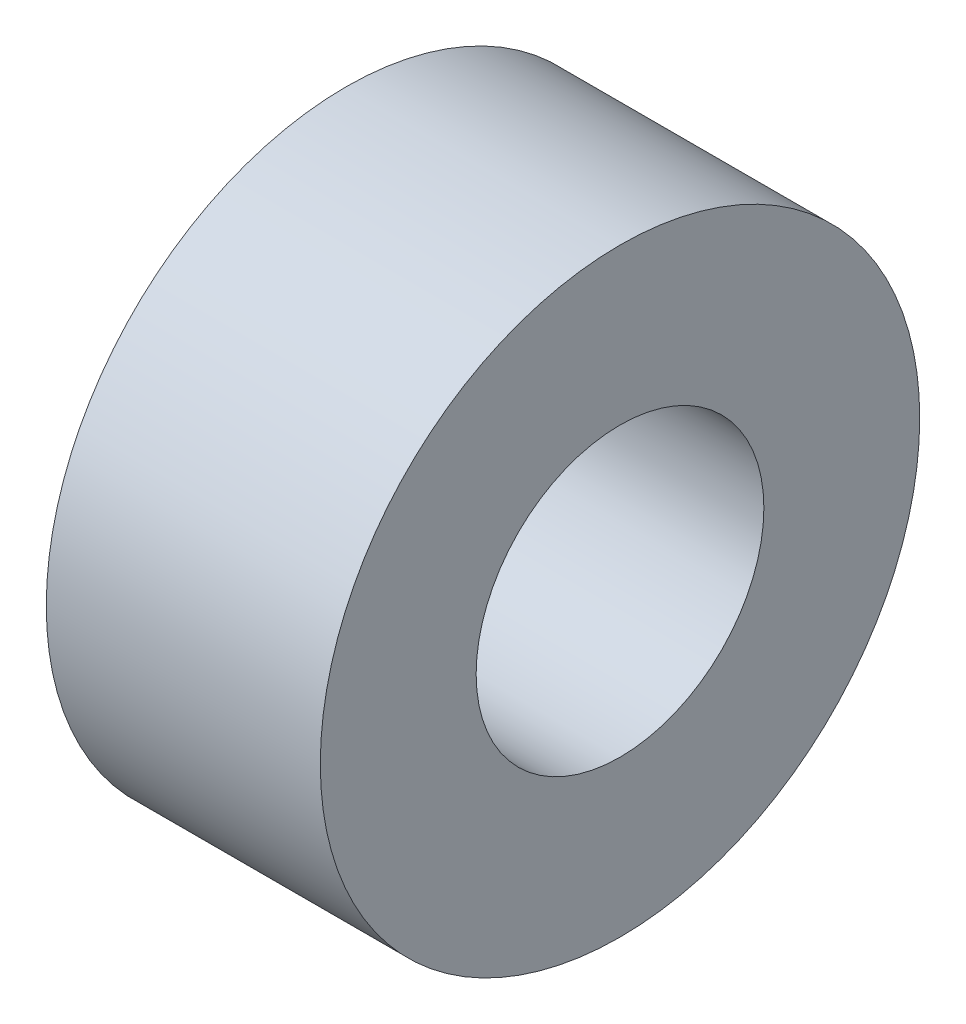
ISO-10303-21;
HEADER;
FILE_DESCRIPTION(('STEP AP214'),'2;1');
FILE_NAME('part.step','',(''),(''),'','','');
FILE_SCHEMA(('AUTOMOTIVE_DESIGN { 1 0 10303 214 1 1 1 1 }'));
ENDSEC;
DATA;
#1=APPLICATION_CONTEXT('core data for automotive mechanical design processes');
#2=APPLICATION_PROTOCOL_DEFINITION('international standard','automotive_design',2000,#1);
#3=PRODUCT_CONTEXT('',#1,'mechanical');
#4=PRODUCT('Part','Part','',(#3));
#5=PRODUCT_RELATED_PRODUCT_CATEGORY('part','',(#4));
#6=PRODUCT_DEFINITION_FORMATION('','',#4);
#7=PRODUCT_DEFINITION_CONTEXT('part definition',#1,'design');
#8=PRODUCT_DEFINITION('design','',#6,#7);
#9=PRODUCT_DEFINITION_SHAPE('','',#8);
#10=(LENGTH_UNIT() NAMED_UNIT(*) SI_UNIT(.MILLI.,.METRE.));
#11=(NAMED_UNIT(*) PLANE_ANGLE_UNIT() SI_UNIT($,.RADIAN.));
#12=(NAMED_UNIT(*) SI_UNIT($,.STERADIAN.) SOLID_ANGLE_UNIT());
#13=UNCERTAINTY_MEASURE_WITH_UNIT(LENGTH_MEASURE(1.E-05),#10,'distance_accuracy_value','');
#14=(GEOMETRIC_REPRESENTATION_CONTEXT(3) GLOBAL_UNCERTAINTY_ASSIGNED_CONTEXT((#13)) GLOBAL_UNIT_ASSIGNED_CONTEXT((#10,
#11,#12)) REPRESENTATION_CONTEXT('',''));
#15=CARTESIAN_POINT('',(0.,0.,0.));
#16=DIRECTION('',(0.,0.,1.));
#17=DIRECTION('',(1.,0.,0.));
#18=AXIS2_PLACEMENT_3D('',#15,#16,#17);
#19=CARTESIAN_POINT('',(0.,0.,-8.75));
#20=DIRECTION('',(1.,0.,0.));
#21=DIRECTION('',(0.,0.,-1.));
#22=AXIS2_PLACEMENT_3D('',#19,#20,#21);
#23=PLANE('',#22);
#24=CARTESIAN_POINT('',(0.,0.,0.));
#25=DIRECTION('',(-1.,0.,0.));
#26=DIRECTION('',(0.,0.,1.));
#27=AXIS2_PLACEMENT_3D('',#24,#25,#26);
#28=CIRCLE('',#27,4.2);
#29=CARTESIAN_POINT('',(0.,0.,4.2));
#30=VERTEX_POINT('',#29);
#31=EDGE_CURVE('E10',#30,#30,#28,.T.);
#32=ORIENTED_EDGE('',*,*,#31,.F.);
#33=EDGE_LOOP('',(#32));
#34=FACE_BOUND('',#33,.T.);
#35=CARTESIAN_POINT('',(0.,0.,0.));
#36=DIRECTION('',(-1.,0.,0.));
#37=DIRECTION('',(0.,0.,1.));
#38=AXIS2_PLACEMENT_3D('',#35,#36,#37);
#39=CIRCLE('',#38,8.75);
#40=CARTESIAN_POINT('',(0.,0.,8.75));
#41=VERTEX_POINT('',#40);
#42=EDGE_CURVE('E45',#41,#41,#39,.T.);
#43=ORIENTED_EDGE('',*,*,#42,.T.);
#44=EDGE_LOOP('',(#43));
#45=FACE_BOUND('',#44,.T.);
#46=ADVANCED_FACE('F31',(#34,#45),#23,.F.);
#47=CARTESIAN_POINT('',(0.,0.,0.));
#48=DIRECTION('',(-1.,0.,0.));
#49=DIRECTION('',(0.,0.,1.));
#50=AXIS2_PLACEMENT_3D('',#47,#48,#49);
#51=CYLINDRICAL_SURFACE('',#50,4.2);
#52=CARTESIAN_POINT('',(8.,0.,0.));
#53=DIRECTION('',(-1.,0.,0.));
#54=DIRECTION('',(0.,0.,1.));
#55=AXIS2_PLACEMENT_3D('',#52,#53,#54);
#56=CIRCLE('',#55,4.2);
#57=CARTESIAN_POINT('',(8.,0.,4.2));
#58=VERTEX_POINT('',#57);
#59=EDGE_CURVE('E37',#58,#58,#56,.T.);
#60=ORIENTED_EDGE('',*,*,#59,.F.);
#61=EDGE_LOOP('',(#60));
#62=FACE_BOUND('',#61,.T.);
#63=ORIENTED_EDGE('',*,*,#31,.T.);
#64=EDGE_LOOP('',(#63));
#65=FACE_BOUND('',#64,.T.);
#66=ADVANCED_FACE('F60',(#62,#65),#51,.F.);
#67=CARTESIAN_POINT('',(8.,0.,-8.75));
#68=DIRECTION('',(-1.,0.,0.));
#69=DIRECTION('',(0.,0.,1.));
#70=AXIS2_PLACEMENT_3D('',#67,#68,#69);
#71=PLANE('',#70);
#72=CARTESIAN_POINT('',(8.,0.,0.));
#73=DIRECTION('',(-1.,0.,0.));
#74=DIRECTION('',(0.,0.,1.));
#75=AXIS2_PLACEMENT_3D('',#72,#73,#74);
#76=CIRCLE('',#75,8.75);
#77=CARTESIAN_POINT('',(8.,0.,8.75));
#78=VERTEX_POINT('',#77);
#79=EDGE_CURVE('E41',#78,#78,#76,.T.);
#80=ORIENTED_EDGE('',*,*,#79,.F.);
#81=EDGE_LOOP('',(#80));
#82=FACE_BOUND('',#81,.T.);
#83=ORIENTED_EDGE('',*,*,#59,.T.);
#84=EDGE_LOOP('',(#83));
#85=FACE_BOUND('',#84,.T.);
#86=ADVANCED_FACE('F55',(#82,#85),#71,.F.);
#87=CARTESIAN_POINT('',(0.,0.,0.));
#88=DIRECTION('',(-1.,0.,0.));
#89=DIRECTION('',(0.,0.,1.));
#90=AXIS2_PLACEMENT_3D('',#87,#88,#89);
#91=CYLINDRICAL_SURFACE('',#90,8.75);
#92=ORIENTED_EDGE('',*,*,#42,.F.);
#93=EDGE_LOOP('',(#92));
#94=FACE_BOUND('',#93,.T.);
#95=ORIENTED_EDGE('',*,*,#79,.T.);
#96=EDGE_LOOP('',(#95));
#97=FACE_BOUND('',#96,.T.);
#98=ADVANCED_FACE('F52',(#94,#97),#91,.T.);
#99=CLOSED_SHELL('',(#46,#66,#86,#98));
#100=MANIFOLD_SOLID_BREP('B2',#99);
#101=ADVANCED_BREP_SHAPE_REPRESENTATION('',(#18,#100),#14);
#102=SHAPE_DEFINITION_REPRESENTATION(#9,#101);
ENDSEC;
END-ISO-10303-21;
